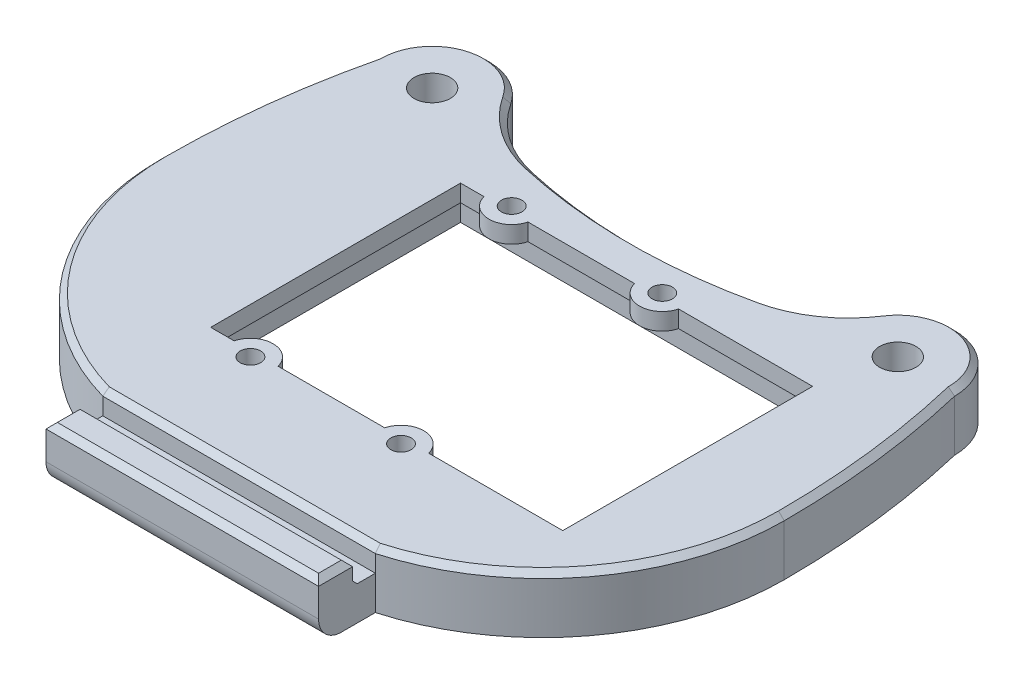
from build123d import *

# Parameters (mm, degrees)
COMPLETE_SKETCH_R                   = 1.6
BODY_DEPTH                          = 5
SMOOTHING_FILLET_R                  = 10
CUT_EXTRUDE1_START                  = -5
SKETCH1_R                           = 0.9
CUT_EXTRUDE1_DEPTH                  = 5
CUT_EXTRUDE2_START                  = -5
SKETCH1_4_W                         = 35
SKETCH1_4_H                         = 26
CUT_EXTRUDE2_DEPTH                  = 3.5
BOSS_EXTRUDE1_DEPTH                 = 24
ELEPHANTSFOOT_COMPENSATION_TOP_SIZE = 0.5
CHAMFER1_SIZE                       = 0.4


with BuildPart() as part:
    # complete_sketch → body (new body)
    with BuildSketch(Plane(origin=(0, 0, 0), x_dir=(1, 0, 0), z_dir=(0, 1, 0))):
        with BuildLine():
            Line((0, -20.5), (24, -20.5))
            ThreePointArc((24, -20.5), (35.188838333, -12.850097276), (39.5, 0))
            ThreePointArc((39.5, 0), (38.998281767, 8.558621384), (37.5, 17))
            ThreePointArc((37.5, 17), (32.5, 22), (27.5, 17))
            ThreePointArc((27.5, 17), (12, 14.321592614), (-3.5, 17))
            ThreePointArc((-3.5, 17), (-8.5, 22), (-13.5, 17))
            ThreePointArc((-13.5, 17), (-14.998281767, 8.558621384), (-15.5, 0))
            ThreePointArc((-15.5, 0), (-11.188838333, -12.850097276), (0, -20.5))
        make_face()
        with Locations(Location((24, 0, 0), (0, 0, 270))):
            Circle(COMPLETE_SKETCH_R, mode=Mode.SUBTRACT)
        with Locations(Location((-8.5, 17, 0), (0, 0, 270))):
            Circle(COMPLETE_SKETCH_R, mode=Mode.SUBTRACT)
        with Locations(Location((32.5, 17, 0), (0, 0, 270))):
            Circle(COMPLETE_SKETCH_R, mode=Mode.SUBTRACT)
    extrude(amount=BODY_DEPTH)

    # smoothing_fillet
    smoothing_fillet_edges = [part.edges().sort_by_distance(p)[0] for p in [
        (-3.5, 2.5, -17),
        (27.5, 2.5, -17),
    ]]
    fillet(smoothing_fillet_edges, radius=SMOOTHING_FILLET_R)

    # Sketch1 → Cut-Extrude1 (cut)
    with BuildSketch(Plane(origin=(0, 5, 0), x_dir=(1, 0, 0), z_dir=(0, 1, 0)).offset(CUT_EXTRUDE1_START)):
        with BuildLine():
            Line((31, -11), (31, 11))
            Line((31, 11), (19.196491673, 11))
            ThreePointArc((19.196491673, 11), (17.26, 9.5), (15.323508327, 11))
            Line((15.323508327, 11), (5.936491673, 11))
            ThreePointArc((5.936491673, 11), (4, 9.5), (2.063508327, 11))
            Line((2.063508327, 11), (0, 11))
            Line((0, 11), (0, -11))
            Line((0, -11), (2.063508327, -11))
            ThreePointArc((2.063508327, -11), (4, -9.5), (5.936491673, -11))
            Line((5.936491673, -11), (15.323508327, -11))
            ThreePointArc((15.323508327, -11), (17.26, -9.5), (19.196491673, -11))
            Line((19.196491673, -11), (31, -11))
        make_face()
        with Locations(Location((4, 11.5, 0), (0, 0, 270))):
            Circle(SKETCH1_R)
        with Locations(Location((17.26, 11.5, 0), (0, 0, 270))):
            Circle(SKETCH1_R)
        with Locations(Location((17.26, -11.5, 0), (0, 0, 270))):
            Circle(SKETCH1_R)
        with Locations(Location((4, -11.5, 0), (0, 0, 270))):
            Circle(SKETCH1_R)
    extrude(amount=CUT_EXTRUDE1_DEPTH, mode=Mode.SUBTRACT)

    # Sketch1_4 → Cut-Extrude2 (cut)
    with BuildSketch(Plane(origin=(0, 5, 0), x_dir=(1, 0, 0), z_dir=(0, 1, 0)).offset(CUT_EXTRUDE2_START)):
        with Locations((15.5, 0)):
            Rectangle(SKETCH1_4_W, SKETCH1_4_H)
    extrude(amount=CUT_EXTRUDE2_DEPTH, mode=Mode.SUBTRACT)

    # Sketch2 → Boss-Extrude1 (add)
    with BuildSketch(Plane(origin=(0, 0, 0), x_dir=(0, 0, -1), z_dir=(1, 0, 0))):
        with BuildLine():
            Line((-20.5, 0), (-23.5, 0))
            ThreePointArc((-23.5, 0), (-24.914213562, 0.585786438), (-25.5, 2))
            Line((-25.5, 2), (-25.5, 5))
            Line((-25.5, 5), (-22.5, 5))
            Line((-22.5, 5), (-22.5, 3))
            Line((-22.5, 3), (-20.5, 3))
            Line((-20.5, 3), (-20.5, 0))
        make_face()
    extrude(amount=BOSS_EXTRUDE1_DEPTH)

    # elephantsfoot_compensation top
    elephantsfoot_compensation_top_edges = [part.edges().sort_by_distance(p)[0] for p in [
        (33.926618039, 5, -21.792156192),
        (25.643793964, 5, -16.988490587),
        (38.998281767, 5, -8.558621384),
        (12, 5, -14.321592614),
        (35.188838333, 5, 12.850097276),
        (-1.643793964, 5, -16.988490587),
        (12, 5, 20.5),
        (-9.926618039, 5, -21.792156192),
        (-11.188838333, 5, 12.850097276),
        (-14.998281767, 5, -8.558621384),
        (24, 5, 24),
        (0, 5, 24),
        (12, 5, 25.5),
        (12, 5, 22.5),
    ]]
    chamfer(elephantsfoot_compensation_top_edges, length=ELEPHANTSFOOT_COMPENSATION_TOP_SIZE)

    # Chamfer1
    chamfer1_edges = [part.edges().sort_by_distance(p)[0] for p in [
        (12, 3, 22.5),
    ]]
    chamfer(chamfer1_edges, length=CHAMFER1_SIZE)


solid = part.part
